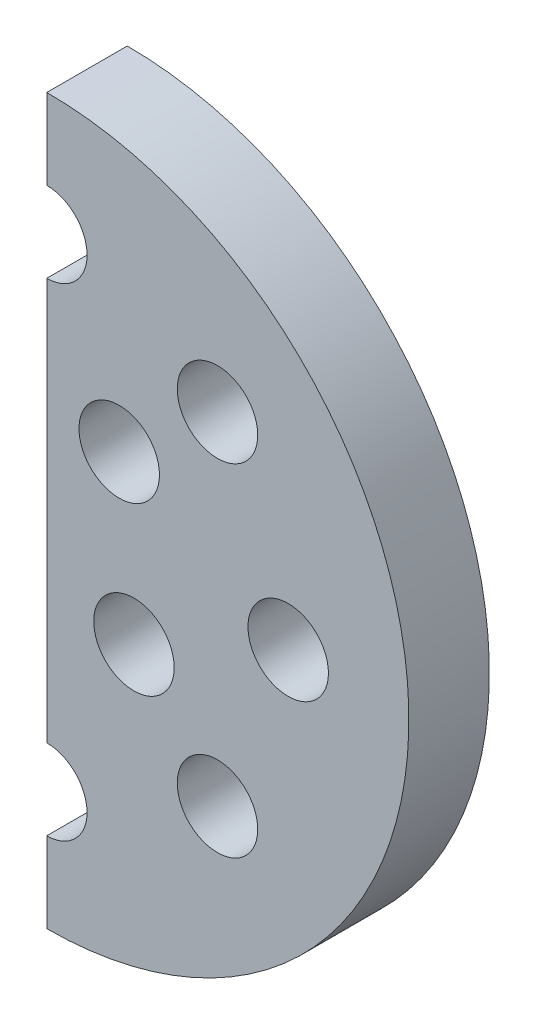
from build123d import *

# Parameters (mm, degrees)
SKETCH1_R               = 275
SKETCH1_R_2             = 25
BOSS_EXTRUDE1_DEPTH     = 50
FILLET1_R               = 10
FILLET2_R               = 10
CUT_EXTRUDE2_DEPTH      = 393.109678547
CUT_EXTRUDE2_DEPTH_BACK = 100
SKETCH2_R               = 320.212067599
SKETCH2_R_2             = 225
CUT_EXTRUDE3_DEPTH      = 100


with BuildPart() as part:
    # Sketch1 → Boss-Extrude1 (new body)
    with BuildSketch(Plane.XY):
        Circle(SKETCH1_R)
        with Locations((0, 150)):
            Circle(SKETCH1_R_2, mode=Mode.SUBTRACT)
        with Locations((106.066017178, 106.066017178)):
            Circle(SKETCH1_R_2, mode=Mode.SUBTRACT)
        with Locations((150, 0)):
            Circle(SKETCH1_R_2, mode=Mode.SUBTRACT)
        with Locations((106.066017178, -106.066017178)):
            Circle(SKETCH1_R_2, mode=Mode.SUBTRACT)
        with Locations((0, -150)):
            Circle(SKETCH1_R_2, mode=Mode.SUBTRACT)
        with Locations((-106.066017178, -106.066017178)):
            Circle(SKETCH1_R_2, mode=Mode.SUBTRACT)
        with Locations((-150, 0)):
            Circle(SKETCH1_R_2, mode=Mode.SUBTRACT)
        with Locations((-106.066017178, 106.066017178)):
            Circle(SKETCH1_R_2, mode=Mode.SUBTRACT)
        with Locations((-54.151001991, 45)):
            Circle(SKETCH1_R_2, mode=Mode.SUBTRACT)
        with Locations((45, 54.151001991)):
            Circle(SKETCH1_R_2, mode=Mode.SUBTRACT)
        with Locations((54.151001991, -45)):
            Circle(SKETCH1_R_2, mode=Mode.SUBTRACT)
        with Locations((-45, -54.151001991)):
            Circle(SKETCH1_R_2, mode=Mode.SUBTRACT)
    extrude(amount=BOSS_EXTRUDE1_DEPTH)

    # Fillet1
    fillet1_edges = [part.edges().sort_by_distance(p)[0] for p in [
        (-275, 0, 50),
    ]]
    fillet(fillet1_edges, radius=FILLET1_R)

    # Fillet2
    fillet2_edges = [part.edges().sort_by_distance(p)[0] for p in [
        (-275, 0, 0),
    ]]
    fillet(fillet2_edges, radius=FILLET2_R)

    # Sketch2 → Cut-Extrude2 (cut, two sides: drawn at the far end of the back side and taken through both)
    with BuildSketch(Plane.XY.offset(-CUT_EXTRUDE2_DEPTH_BACK)):
        Circle(SKETCH2_R)
        Circle(SKETCH2_R_2, mode=Mode.SUBTRACT)
    extrude(amount=CUT_EXTRUDE2_DEPTH + CUT_EXTRUDE2_DEPTH_BACK, mode=Mode.SUBTRACT)

    # Sketch3 → Cut-Extrude3 (cut)
    with BuildSketch(Plane.XY):
        with BuildLine():
            Line((0, 225), (0, -225))
            ThreePointArc((0, -225), (-225, 0), (0, 225))
        make_face()
    extrude(amount=CUT_EXTRUDE3_DEPTH, mode=Mode.SUBTRACT)


solid = part.part
